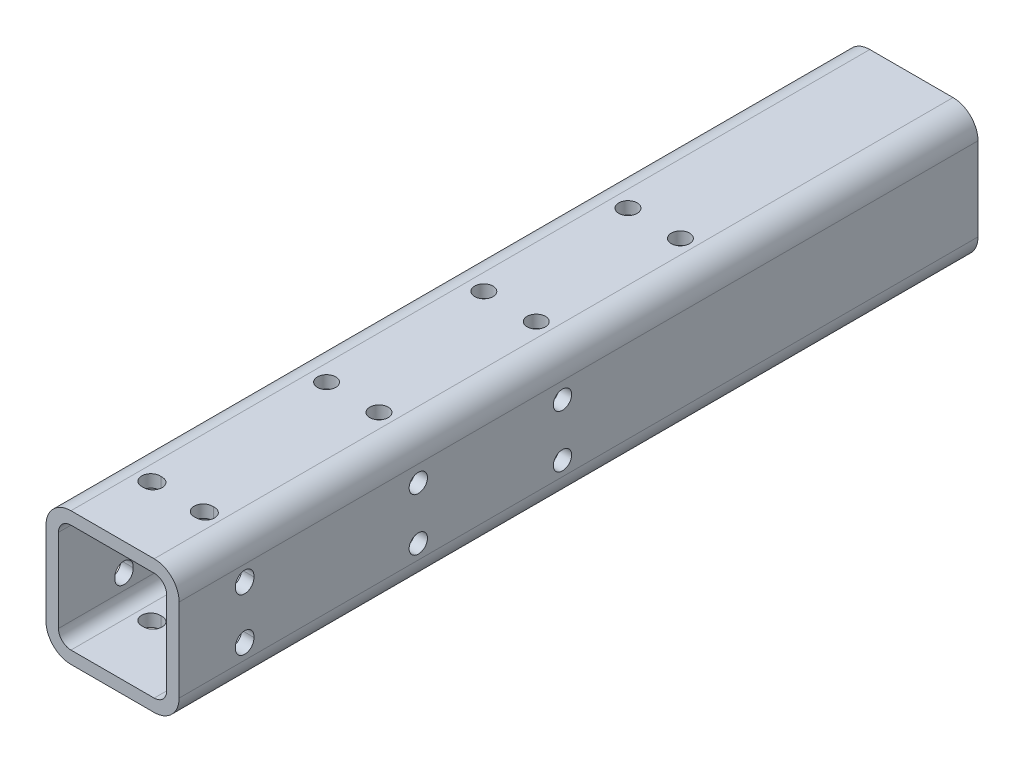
from build123d import *

# Parameters (mm, degrees)
BOSS_EXTRUDE1_DEPTH = 304.8
SKETCH2_R           = 3.5
CUT_EXTRUDE1_DEPTH  = 178.054
SKETCH3_R           = 3.5
CUT_EXTRUDE2_DEPTH  = 141.064
SKETCH4_R           = 3.5
CUT_EXTRUDE3_DEPTH  = 70.358
CIRPATTERN1_COUNT   = 4


with BuildPart() as part:
    # Sketch1 → Boss-Extrude1 (new body)
    with BuildSketch(Plane.XY):
        with BuildLine():
            Line((9.525, 50.8), (41.275, 50.8))
            ThreePointArc((41.275, 50.8), (48.010192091, 48.010192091), (50.8, 41.275))
            Line((50.8, 41.275), (50.8, 9.525))
            ThreePointArc((50.8, 9.525), (48.010192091, 2.789807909), (41.275, 0))
            Line((41.275, 0), (9.525, 0))
            ThreePointArc((9.525, 0), (2.789807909, 2.789807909), (0, 9.525))
            Line((0, 9.525), (0, 41.275))
            ThreePointArc((0, 41.275), (2.789807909, 48.010192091), (9.525, 50.8))
        make_face()
        with BuildLine():
            Line((9.525, 46.0375), (41.275, 46.0375))
            ThreePointArc((41.275, 46.0375), (44.642596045, 44.642596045), (46.0375, 41.275))
            Line((46.0375, 41.275), (46.0375, 9.525))
            ThreePointArc((46.0375, 9.525), (44.642596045, 6.157403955), (41.275, 4.7625))
            Line((41.275, 4.7625), (9.525, 4.7625))
            ThreePointArc((9.525, 4.7625), (6.157403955, 6.157403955), (4.7625, 9.525))
            Line((4.7625, 9.525), (4.7625, 41.275))
            ThreePointArc((4.7625, 41.275), (6.157403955, 44.642596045), (9.525, 46.0375))
        make_face(mode=Mode.SUBTRACT)
    extrude(amount=BOSS_EXTRUDE1_DEPTH)

    # Sketch2 → Cut-Extrude1 (cut)
    with BuildSketch(Plane.ZY):
        with Locations((213.54800001, 35)):
            Circle(SKETCH2_R)
        with Locations((213.54800001, 15)):
            Circle(SKETCH2_R)
        with Locations((158.54800001, 15)):
            Circle(SKETCH2_R)
        with Locations((158.54800001, 35)):
            Circle(SKETCH2_R)
    extrude(amount=-CUT_EXTRUDE1_DEPTH, mode=Mode.SUBTRACT)

    # Sketch3 → Cut-Extrude2 (cut)
    with BuildSketch(Plane(origin=(0, 50.8, 0), x_dir=(1, 0, 0), z_dir=(0, 1, 0))):
        with Locations(Location((15.8, -98.54799999, 0), (0, 0, 270))):
            Circle(SKETCH3_R)
        with Locations(Location((35.8, -98.54799999, 0), (0, 0, 270))):
            Circle(SKETCH3_R)
        with Locations(Location((15.8, -153.54799999, 0), (0, 0, 270))):
            Circle(SKETCH3_R)
        with Locations(Location((35.8, -153.54799999, 0), (0, 0, 270))):
            Circle(SKETCH3_R)
        with Locations(Location((35.8, -213.54800001, 0), (0, 0, 270))):
            Circle(SKETCH3_R)
        with Locations(Location((15.8, -213.54800001, 0), (0, 0, 270))):
            Circle(SKETCH3_R)
    extrude(amount=-CUT_EXTRUDE2_DEPTH, mode=Mode.SUBTRACT)

    # Sketch4 → Cut-Extrude3 (cut)
    with BuildSketch(Plane(origin=(0, 50.8, 0), x_dir=(1, 0, 0), z_dir=(0, 1, 0))):
        with Locations(Location((35.8, -279.79999999, 0), (0, 0, 270))):
            Circle(SKETCH4_R)
        with Locations(Location((15.8, -279.79999999, 0), (0, 0, 270))):
            Circle(SKETCH4_R)
    cut_extrude3 = extrude(amount=-CUT_EXTRUDE3_DEPTH, mode=Mode.SUBTRACT)

    # CirPattern1: Cut-Extrude3 ×4 about axis
    cirpattern1_axis = Axis((25.4, 25.4, 0), (0, 0, 1))
    for i in range(1, CIRPATTERN1_COUNT):
        add(cut_extrude3.rotate(cirpattern1_axis, i * 360 / CIRPATTERN1_COUNT), mode=Mode.SUBTRACT)


solid = part.part
